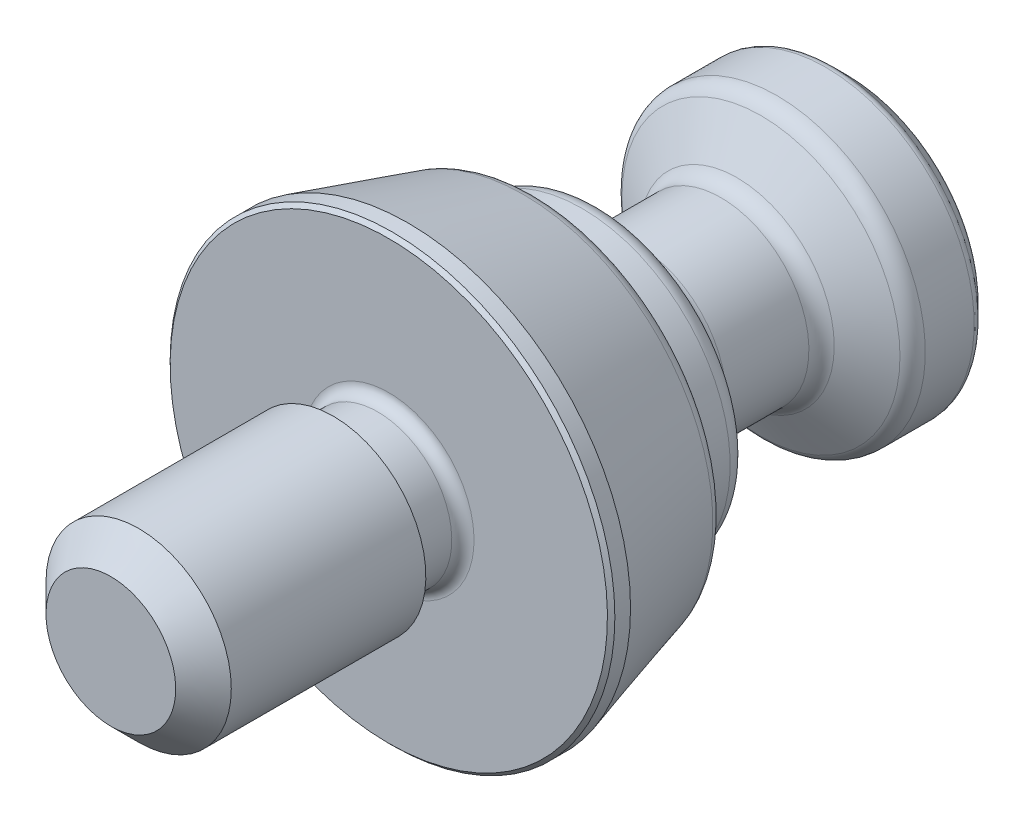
ISO-10303-21;
HEADER;
FILE_DESCRIPTION(('STEP AP214'),'2;1');
FILE_NAME('part.step','',(''),(''),'','','');
FILE_SCHEMA(('AUTOMOTIVE_DESIGN { 1 0 10303 214 1 1 1 1 }'));
ENDSEC;
DATA;
#1=APPLICATION_CONTEXT('core data for automotive mechanical design processes');
#2=APPLICATION_PROTOCOL_DEFINITION('international standard','automotive_design',2000,#1);
#3=PRODUCT_CONTEXT('',#1,'mechanical');
#4=PRODUCT('Part','Part','',(#3));
#5=PRODUCT_RELATED_PRODUCT_CATEGORY('part','',(#4));
#6=PRODUCT_DEFINITION_FORMATION('','',#4);
#7=PRODUCT_DEFINITION_CONTEXT('part definition',#1,'design');
#8=PRODUCT_DEFINITION('design','',#6,#7);
#9=PRODUCT_DEFINITION_SHAPE('','',#8);
#10=(LENGTH_UNIT() NAMED_UNIT(*) SI_UNIT(.MILLI.,.METRE.));
#11=(NAMED_UNIT(*) PLANE_ANGLE_UNIT() SI_UNIT($,.RADIAN.));
#12=(NAMED_UNIT(*) SI_UNIT($,.STERADIAN.) SOLID_ANGLE_UNIT());
#13=UNCERTAINTY_MEASURE_WITH_UNIT(LENGTH_MEASURE(1.E-05),#10,'distance_accuracy_value','');
#14=(GEOMETRIC_REPRESENTATION_CONTEXT(3) GLOBAL_UNCERTAINTY_ASSIGNED_CONTEXT((#13)) GLOBAL_UNIT_ASSIGNED_CONTEXT((#10,
#11,#12)) REPRESENTATION_CONTEXT('',''));
#15=CARTESIAN_POINT('',(0.,0.,0.));
#16=DIRECTION('',(0.,0.,1.));
#17=DIRECTION('',(1.,0.,0.));
#18=AXIS2_PLACEMENT_3D('',#15,#16,#17);
#19=CARTESIAN_POINT('',(2.88675134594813,0.,-21.5));
#20=DIRECTION('',(0.,0.,-1.));
#21=DIRECTION('',(0.,1.,0.));
#22=AXIS2_PLACEMENT_3D('',#19,#20,#21);
#23=PLANE('',#22);
#24=DIRECTION('',(-0.5,0.866025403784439,0.));
#25=VECTOR('',#24,1.);
#26=CARTESIAN_POINT('',(-1.44337567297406,-2.49999999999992,-21.5));
#27=LINE('',#26,#25);
#28=CARTESIAN_POINT('',(-1.44337567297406,-2.49999999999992,-21.5));
#29=VERTEX_POINT('',#28);
#30=CARTESIAN_POINT('',(-2.88675134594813,0.,-21.5));
#31=VERTEX_POINT('',#30);
#32=EDGE_CURVE('E594',#29,#31,#27,.T.);
#33=ORIENTED_EDGE('',*,*,#32,.T.);
#34=DIRECTION('',(0.5,0.866025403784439,0.));
#35=VECTOR('',#34,1.);
#36=CARTESIAN_POINT('',(-2.88675134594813,0.,-21.5));
#37=LINE('',#36,#35);
#38=CARTESIAN_POINT('',(-1.44337567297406,2.50000000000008,-21.5));
#39=VERTEX_POINT('',#38);
#40=EDGE_CURVE('E595',#31,#39,#37,.T.);
#41=ORIENTED_EDGE('',*,*,#40,.T.);
#42=DIRECTION('',(1.,0.,0.));
#43=VECTOR('',#42,1.);
#44=CARTESIAN_POINT('',(-1.44337567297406,2.50000000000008,-21.5));
#45=LINE('',#44,#43);
#46=CARTESIAN_POINT('',(1.44337567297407,2.50000000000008,-21.5));
#47=VERTEX_POINT('',#46);
#48=EDGE_CURVE('E37',#39,#47,#45,.T.);
#49=ORIENTED_EDGE('',*,*,#48,.T.);
#50=DIRECTION('',(0.5,-0.866025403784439,0.));
#51=VECTOR('',#50,1.);
#52=CARTESIAN_POINT('',(1.44337567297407,2.50000000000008,-21.5));
#53=LINE('',#52,#51);
#54=CARTESIAN_POINT('',(2.88675134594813,0.,-21.5));
#55=VERTEX_POINT('',#54);
#56=EDGE_CURVE('E85',#47,#55,#53,.T.);
#57=ORIENTED_EDGE('',*,*,#56,.T.);
#58=DIRECTION('',(-0.5,-0.866025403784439,0.));
#59=VECTOR('',#58,1.);
#60=CARTESIAN_POINT('',(2.88675134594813,0.,-21.5));
#61=LINE('',#60,#59);
#62=CARTESIAN_POINT('',(1.44337567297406,-2.49999999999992,-21.5));
#63=VERTEX_POINT('',#62);
#64=EDGE_CURVE('E598',#55,#63,#61,.T.);
#65=ORIENTED_EDGE('',*,*,#64,.T.);
#66=DIRECTION('',(-1.,0.,0.));
#67=VECTOR('',#66,1.);
#68=CARTESIAN_POINT('',(1.44337567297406,-2.49999999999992,-21.5));
#69=LINE('',#68,#67);
#70=EDGE_CURVE('E596',#63,#29,#69,.T.);
#71=ORIENTED_EDGE('',*,*,#70,.T.);
#72=EDGE_LOOP('',(#33,#41,#49,#57,#65,#71));
#73=FACE_BOUND('',#72,.T.);
#74=ADVANCED_FACE('F14',(#73),#23,.T.);
#75=CARTESIAN_POINT('',(8.0005,0.,-25.));
#76=DIRECTION('',(0.,0.,-1.));
#77=DIRECTION('',(0.,1.,0.));
#78=AXIS2_PLACEMENT_3D('',#75,#76,#77);
#79=PLANE('',#78);
#80=CARTESIAN_POINT('',(0.,0.,-25.));
#81=DIRECTION('',(0.,0.,-1.));
#82=DIRECTION('',(0.,1.,0.));
#83=AXIS2_PLACEMENT_3D('',#80,#81,#82);
#84=CIRCLE('',#83,6.38578643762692);
#85=CARTESIAN_POINT('',(0.,6.38578643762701,-25.));
#86=VERTEX_POINT('',#85);
#87=EDGE_CURVE('E129',#86,#86,#84,.T.);
#88=ORIENTED_EDGE('',*,*,#87,.T.);
#89=EDGE_LOOP('',(#88));
#90=FACE_BOUND('',#89,.T.);
#91=CARTESIAN_POINT('',(0.,0.,-25.));
#92=DIRECTION('',(0.,0.,1.));
#93=DIRECTION('',(0.,-1.,0.));
#94=AXIS2_PLACEMENT_3D('',#91,#92,#93);
#95=CIRCLE('',#94,3.2);
#96=CARTESIAN_POINT('',(0.,-3.19999999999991,-25.));
#97=VERTEX_POINT('',#96);
#98=EDGE_CURVE('E73',#97,#97,#95,.T.);
#99=ORIENTED_EDGE('',*,*,#98,.T.);
#100=EDGE_LOOP('',(#99));
#101=FACE_BOUND('',#100,.T.);
#102=ADVANCED_FACE('F184',(#90,#101),#79,.T.);
#103=CARTESIAN_POINT('',(0.,0.,0.));
#104=DIRECTION('',(0.,0.,1.));
#105=DIRECTION('',(0.,-1.,0.));
#106=AXIS2_PLACEMENT_3D('',#103,#104,#105);
#107=CYLINDRICAL_SURFACE('',#106,8.);
#108=CARTESIAN_POINT('',(0.,0.,-20.9537386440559));
#109=DIRECTION('',(0.,0.,-1.));
#110=DIRECTION('',(0.,1.,0.));
#111=AXIS2_PLACEMENT_3D('',#108,#109,#110);
#112=CIRCLE('',#111,8.);
#113=CARTESIAN_POINT('',(0.,8.00000000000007,-20.9537386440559));
#114=VERTEX_POINT('',#113);
#115=EDGE_CURVE('E153',#114,#114,#112,.T.);
#116=ORIENTED_EDGE('',*,*,#115,.T.);
#117=EDGE_LOOP('',(#116));
#118=FACE_BOUND('',#117,.T.);
#119=CARTESIAN_POINT('',(0.,0.,-23.5928932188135));
#120=DIRECTION('',(0.,0.,-1.));
#121=DIRECTION('',(0.,1.,0.));
#122=AXIS2_PLACEMENT_3D('',#119,#120,#121);
#123=CIRCLE('',#122,8.);
#124=CARTESIAN_POINT('',(0.,8.00000000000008,-23.5928932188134));
#125=VERTEX_POINT('',#124);
#126=EDGE_CURVE('E114',#125,#125,#123,.F.);
#127=ORIENTED_EDGE('',*,*,#126,.T.);
#128=EDGE_LOOP('',(#127));
#129=FACE_BOUND('',#128,.T.);
#130=ADVANCED_FACE('F189',(#118,#129),#107,.T.);
#131=CARTESIAN_POINT('',(0.,0.,0.));
#132=DIRECTION('',(0.,0.,-1.));
#133=DIRECTION('',(0.,1.,0.));
#134=AXIS2_PLACEMENT_3D('',#131,#132,#133);
#135=CYLINDRICAL_SURFACE('',#134,8.0005);
#136=CARTESIAN_POINT('',(0.,0.,-8.4));
#137=DIRECTION('',(0.,0.,-1.));
#138=DIRECTION('',(0.,1.,0.));
#139=AXIS2_PLACEMENT_3D('',#136,#137,#138);
#140=CIRCLE('',#139,8.0005);
#141=CARTESIAN_POINT('',(0.,8.00050000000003,-8.39999999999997));
#142=VERTEX_POINT('',#141);
#143=EDGE_CURVE('E9',#142,#142,#140,.T.);
#144=ORIENTED_EDGE('',*,*,#143,.T.);
#145=EDGE_LOOP('',(#144));
#146=FACE_BOUND('',#145,.T.);
#147=CARTESIAN_POINT('',(0.,0.,-10.4226497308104));
#148=DIRECTION('',(0.,0.,-1.));
#149=DIRECTION('',(0.,1.,0.));
#150=AXIS2_PLACEMENT_3D('',#147,#148,#149);
#151=CIRCLE('',#150,8.0005);
#152=CARTESIAN_POINT('',(0.,8.00050000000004,-10.4226497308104));
#153=VERTEX_POINT('',#152);
#154=EDGE_CURVE('E144',#153,#153,#151,.F.);
#155=ORIENTED_EDGE('',*,*,#154,.T.);
#156=EDGE_LOOP('',(#155));
#157=FACE_BOUND('',#156,.T.);
#158=ADVANCED_FACE('F273',(#146,#157),#135,.T.);
#159=CARTESIAN_POINT('',(0.,0.,0.));
#160=DIRECTION('',(0.,0.,1.));
#161=DIRECTION('',(0.,-1.,0.));
#162=AXIS2_PLACEMENT_3D('',#159,#160,#161);
#163=CYLINDRICAL_SURFACE('',#162,4.75);
#164=CARTESIAN_POINT('',(0.,0.,-17.9226497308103));
#165=DIRECTION('',(0.,0.,1.));
#166=DIRECTION('',(0.,-1.,0.));
#167=AXIS2_PLACEMENT_3D('',#164,#165,#166);
#168=CIRCLE('',#167,4.75);
#169=CARTESIAN_POINT('',(0.,-4.74999999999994,-17.9226497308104));
#170=VERTEX_POINT('',#169);
#171=EDGE_CURVE('E89',#170,#170,#168,.T.);
#172=ORIENTED_EDGE('',*,*,#171,.T.);
#173=EDGE_LOOP('',(#172));
#174=FACE_BOUND('',#173,.T.);
#175=CARTESIAN_POINT('',(0.,0.,-13.4540273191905));
#176=DIRECTION('',(0.,0.,1.));
#177=DIRECTION('',(0.,-1.,0.));
#178=AXIS2_PLACEMENT_3D('',#175,#176,#177);
#179=CIRCLE('',#178,4.75);
#180=CARTESIAN_POINT('',(0.,-4.74999999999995,-13.4540273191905));
#181=VERTEX_POINT('',#180);
#182=EDGE_CURVE('E86',#181,#181,#179,.F.);
#183=ORIENTED_EDGE('',*,*,#182,.T.);
#184=EDGE_LOOP('',(#183));
#185=FACE_BOUND('',#184,.T.);
#186=ADVANCED_FACE('F277',(#174,#185),#163,.T.);
#187=CARTESIAN_POINT('',(0.,0.,-18.5));
#188=DIRECTION('',(0.,0.,-1.));
#189=DIRECTION('',(0.,1.,0.));
#190=AXIS2_PLACEMENT_3D('',#187,#188,#189);
#191=CONICAL_SURFACE('',#190,4.75,1.0471975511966);
#192=CARTESIAN_POINT('',(0.,0.,-20.0877132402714));
#193=DIRECTION('',(0.,0.,1.));
#194=DIRECTION('',(0.,-1.,0.));
#195=AXIS2_PLACEMENT_3D('',#192,#193,#194);
#196=CIRCLE('',#195,7.5);
#197=CARTESIAN_POINT('',(0.,-7.49999999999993,-20.0877132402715));
#198=VERTEX_POINT('',#197);
#199=EDGE_CURVE('E150',#198,#198,#196,.T.);
#200=ORIENTED_EDGE('',*,*,#199,.T.);
#201=EDGE_LOOP('',(#200));
#202=FACE_BOUND('',#201,.T.);
#203=CARTESIAN_POINT('',(0.,0.,-18.7886751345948));
#204=DIRECTION('',(0.,0.,-1.));
#205=DIRECTION('',(0.,1.,0.));
#206=AXIS2_PLACEMENT_3D('',#203,#204,#205);
#207=CIRCLE('',#206,5.25);
#208=CARTESIAN_POINT('',(0.,5.25000000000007,-18.7886751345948));
#209=VERTEX_POINT('',#208);
#210=EDGE_CURVE('E108',#209,#209,#207,.T.);
#211=ORIENTED_EDGE('',*,*,#210,.T.);
#212=EDGE_LOOP('',(#211));
#213=FACE_BOUND('',#212,.T.);
#214=ADVANCED_FACE('F269',(#202,#213),#191,.T.);
#215=CARTESIAN_POINT('',(0.,0.,-11.));
#216=DIRECTION('',(0.,0.,1.));
#217=DIRECTION('',(0.,-1.,0.));
#218=AXIS2_PLACEMENT_3D('',#215,#216,#217);
#219=CONICAL_SURFACE('',#218,8.0005,1.0471975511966);
#220=CARTESIAN_POINT('',(0.,0.,-11.2886751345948));
#221=DIRECTION('',(0.,0.,-1.));
#222=DIRECTION('',(0.,1.,0.));
#223=AXIS2_PLACEMENT_3D('',#220,#221,#222);
#224=CIRCLE('',#223,7.5005);
#225=CARTESIAN_POINT('',(0.,7.50050000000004,-11.2886751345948));
#226=VERTEX_POINT('',#225);
#227=EDGE_CURVE('E147',#226,#226,#224,.T.);
#228=ORIENTED_EDGE('',*,*,#227,.T.);
#229=EDGE_LOOP('',(#228));
#230=FACE_BOUND('',#229,.T.);
#231=CARTESIAN_POINT('',(0.,0.,-12.5880019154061));
#232=DIRECTION('',(0.,0.,1.));
#233=DIRECTION('',(0.,-1.,0.));
#234=AXIS2_PLACEMENT_3D('',#231,#232,#233);
#235=CIRCLE('',#234,5.25);
#236=CARTESIAN_POINT('',(0.,-5.24999999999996,-12.5880019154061));
#237=VERTEX_POINT('',#236);
#238=EDGE_CURVE('E111',#237,#237,#235,.T.);
#239=ORIENTED_EDGE('',*,*,#238,.T.);
#240=EDGE_LOOP('',(#239));
#241=FACE_BOUND('',#240,.T.);
#242=ADVANCED_FACE('F266',(#230,#241),#219,.T.);
#243=CARTESIAN_POINT('',(0.,0.,-23.8));
#244=DIRECTION('',(0.,0.,1.));
#245=DIRECTION('',(0.,-1.,0.));
#246=AXIS2_PLACEMENT_3D('',#243,#244,#245);
#247=CONICAL_SURFACE('',#246,8.,0.785398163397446);
#248=CARTESIAN_POINT('',(0.,0.,-24.7071067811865));
#249=DIRECTION('',(0.,0.,-1.));
#250=DIRECTION('',(0.,1.,0.));
#251=AXIS2_PLACEMENT_3D('',#248,#249,#250);
#252=CIRCLE('',#251,7.09289321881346);
#253=CARTESIAN_POINT('',(0.,7.09289321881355,-24.7071067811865));
#254=VERTEX_POINT('',#253);
#255=EDGE_CURVE('E126',#254,#254,#252,.F.);
#256=ORIENTED_EDGE('',*,*,#255,.T.);
#257=EDGE_LOOP('',(#256));
#258=FACE_BOUND('',#257,.T.);
#259=CARTESIAN_POINT('',(0.,0.,-23.9464466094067));
#260=DIRECTION('',(0.,0.,-1.));
#261=DIRECTION('',(0.,1.,0.));
#262=AXIS2_PLACEMENT_3D('',#259,#260,#261);
#263=CIRCLE('',#262,7.85355339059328);
#264=CARTESIAN_POINT('',(0.,7.85355339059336,-23.9464466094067));
#265=VERTEX_POINT('',#264);
#266=EDGE_CURVE('E117',#265,#265,#263,.T.);
#267=ORIENTED_EDGE('',*,*,#266,.T.);
#268=EDGE_LOOP('',(#267));
#269=FACE_BOUND('',#268,.T.);
#270=ADVANCED_FACE('F194',(#258,#269),#247,.T.);
#271=CARTESIAN_POINT('',(0.,0.,-17.9226497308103));
#272=DIRECTION('',(0.,0.,1.));
#273=DIRECTION('',(0.,-1.,0.));
#274=AXIS2_PLACEMENT_3D('',#271,#272,#273);
#275=TOROIDAL_SURFACE('',#274,5.75,1.);
#276=ORIENTED_EDGE('',*,*,#210,.F.);
#277=EDGE_LOOP('',(#276));
#278=FACE_BOUND('',#277,.T.);
#279=ORIENTED_EDGE('',*,*,#171,.F.);
#280=EDGE_LOOP('',(#279));
#281=FACE_BOUND('',#280,.T.);
#282=ADVANCED_FACE('F300',(#278,#281),#275,.F.);
#283=CARTESIAN_POINT('',(0.,0.,-13.4540273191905));
#284=DIRECTION('',(0.,0.,1.));
#285=DIRECTION('',(0.,-1.,0.));
#286=AXIS2_PLACEMENT_3D('',#283,#284,#285);
#287=TOROIDAL_SURFACE('',#286,5.75,1.);
#288=ORIENTED_EDGE('',*,*,#182,.F.);
#289=EDGE_LOOP('',(#288));
#290=FACE_BOUND('',#289,.T.);
#291=ORIENTED_EDGE('',*,*,#238,.F.);
#292=EDGE_LOOP('',(#291));
#293=FACE_BOUND('',#292,.T.);
#294=ADVANCED_FACE('F303',(#290,#293),#287,.F.);
#295=CARTESIAN_POINT('',(0.,0.,-23.5928932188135));
#296=DIRECTION('',(0.,0.,-1.));
#297=DIRECTION('',(0.,1.,0.));
#298=AXIS2_PLACEMENT_3D('',#295,#296,#297);
#299=TOROIDAL_SURFACE('',#298,7.5,0.5);
#300=ORIENTED_EDGE('',*,*,#266,.F.);
#301=EDGE_LOOP('',(#300));
#302=FACE_BOUND('',#301,.T.);
#303=ORIENTED_EDGE('',*,*,#126,.F.);
#304=EDGE_LOOP('',(#303));
#305=FACE_BOUND('',#304,.T.);
#306=ADVANCED_FACE('F307',(#302,#305),#299,.T.);
#307=CARTESIAN_POINT('',(0.,0.,-24.));
#308=DIRECTION('',(0.,0.,-1.));
#309=DIRECTION('',(0.,1.,0.));
#310=AXIS2_PLACEMENT_3D('',#307,#308,#309);
#311=TOROIDAL_SURFACE('',#310,6.38578643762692,1.);
#312=ORIENTED_EDGE('',*,*,#87,.F.);
#313=EDGE_LOOP('',(#312));
#314=FACE_BOUND('',#313,.T.);
#315=ORIENTED_EDGE('',*,*,#255,.F.);
#316=EDGE_LOOP('',(#315));
#317=FACE_BOUND('',#316,.T.);
#318=ADVANCED_FACE('F223',(#314,#317),#311,.T.);
#319=CARTESIAN_POINT('',(0.,0.,-25.));
#320=DIRECTION('',(0.,0.,-1.));
#321=DIRECTION('',(0.,1.,0.));
#322=AXIS2_PLACEMENT_3D('',#319,#320,#321);
#323=CONICAL_SURFACE('',#322,3.2,1.0471975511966);
#324=ORIENTED_EDGE('',*,*,#98,.F.);
#325=EDGE_LOOP('',(#324));
#326=FACE_BOUND('',#325,.T.);
#327=CARTESIAN_POINT('',(1.44326020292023,-2.50019999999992,-24.8192124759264));
#328=CARTESIAN_POINT('',(1.50668977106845,-2.39033676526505,-24.7825764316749));
#329=CARTESIAN_POINT('',(1.57066685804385,-2.27952520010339,-24.7492570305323));
#330=CARTESIAN_POINT('',(1.69972891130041,-2.05598316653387,-24.6910970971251));
#331=CARTESIAN_POINT('',(1.7648161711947,-1.94324872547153,-24.666277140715));
#332=CARTESIAN_POINT('',(1.8941840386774,-1.71917700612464,-24.6276404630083));
#333=CARTESIAN_POINT('',(1.95844473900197,-1.60787420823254,-24.6135666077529));
#334=CARTESIAN_POINT('',(2.08726857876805,-1.38474477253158,-24.59676396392));
#335=CARTESIAN_POINT('',(2.15183124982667,-1.27291894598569,-24.5940212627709));
#336=CARTESIAN_POINT('',(2.27247489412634,-1.06395802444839,-24.5997205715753));
#337=CARTESIAN_POINT('',(2.32857390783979,-0.966791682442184,-24.6067632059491));
#338=CARTESIAN_POINT('',(2.44040644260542,-0.773092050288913,-24.6290862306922));
#339=CARTESIAN_POINT('',(2.49613957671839,-0.676559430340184,-24.6443742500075));
#340=CARTESIAN_POINT('',(2.60820277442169,-0.48246027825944,-24.6825939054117));
#341=CARTESIAN_POINT('',(2.66451865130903,-0.384918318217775,-24.7056875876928));
#342=CARTESIAN_POINT('',(2.77631036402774,-0.19128939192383,-24.7581014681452));
#343=CARTESIAN_POINT('',(2.83178763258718,-0.0951999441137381,-24.7874093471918));
#344=CARTESIAN_POINT('',(2.88686681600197,0.00020000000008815,-24.8192124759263));
#345=B_SPLINE_CURVE_WITH_KNOTS('',3,(#327,#328,#329,#330,#331,#332,#333,#334,#335,#336,#337,
#338,#339,#340,#341,#342,#343,#344),.UNSPECIFIED.,.F.,.F.,(4,2,2,2,2,2,2,2,4),(0.,
0.396285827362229,0.793524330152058,1.18093086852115,1.56786160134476,1.90479741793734,
2.24204551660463,2.58677531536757,2.93082800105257),.UNSPECIFIED.);
#346=CARTESIAN_POINT('',(1.44337567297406,-2.49999999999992,-24.8191458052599));
#347=VERTEX_POINT('',#346);
#348=CARTESIAN_POINT('',(2.88675134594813,0.,-24.8191458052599));
#349=VERTEX_POINT('',#348);
#350=EDGE_CURVE('E29',#347,#349,#345,.T.);
#351=ORIENTED_EDGE('',*,*,#350,.T.);
#352=CARTESIAN_POINT('',(2.88686681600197,-0.000199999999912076,-24.8192124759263));
#353=CARTESIAN_POINT('',(2.82343724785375,0.109663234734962,-24.7825764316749));
#354=CARTESIAN_POINT('',(2.75946016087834,0.220474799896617,-24.7492570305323));
#355=CARTESIAN_POINT('',(2.63039810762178,0.44401683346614,-24.6910970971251));
#356=CARTESIAN_POINT('',(2.5653108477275,0.556751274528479,-24.666277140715));
#357=CARTESIAN_POINT('',(2.43594298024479,0.780822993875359,-24.6276404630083));
#358=CARTESIAN_POINT('',(2.37168227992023,0.892125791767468,-24.6135666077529));
#359=CARTESIAN_POINT('',(2.24285844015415,1.11525522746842,-24.59676396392));
#360=CARTESIAN_POINT('',(2.17829576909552,1.22708105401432,-24.5940212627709));
#361=CARTESIAN_POINT('',(2.05765212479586,1.43604197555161,-24.5997205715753));
#362=CARTESIAN_POINT('',(2.0015531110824,1.53320831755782,-24.6067632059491));
#363=CARTESIAN_POINT('',(1.88972057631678,1.72690794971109,-24.6290862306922));
#364=CARTESIAN_POINT('',(1.8339874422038,1.82344056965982,-24.6443742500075));
#365=CARTESIAN_POINT('',(1.72192424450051,2.01753972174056,-24.6825939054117));
#366=CARTESIAN_POINT('',(1.66560836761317,2.11508168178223,-24.7056875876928));
#367=CARTESIAN_POINT('',(1.55381665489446,2.30871060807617,-24.7581014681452));
#368=CARTESIAN_POINT('',(1.49833938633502,2.40480005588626,-24.7874093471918));
#369=CARTESIAN_POINT('',(1.44326020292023,2.50020000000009,-24.8192124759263));
#370=B_SPLINE_CURVE_WITH_KNOTS('',3,(#352,#353,#354,#355,#356,#357,#358,#359,#360,#361,#362,
#363,#364,#365,#366,#367,#368,#369),.UNSPECIFIED.,.F.,.F.,(4,2,2,2,2,2,2,2,4),(0.,
0.396285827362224,0.793524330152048,1.18093086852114,1.56786160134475,1.90479741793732,
2.24204551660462,2.58677531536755,2.93082800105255),.UNSPECIFIED.);
#371=CARTESIAN_POINT('',(1.44337567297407,2.50000000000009,-24.8191458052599));
#372=VERTEX_POINT('',#371);
#373=EDGE_CURVE('E64',#349,#372,#370,.T.);
#374=ORIENTED_EDGE('',*,*,#373,.T.);
#375=CARTESIAN_POINT('',(-3.77372348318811,2.50000000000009,-25.7659690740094));
#376=CARTESIAN_POINT('',(-3.66532713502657,2.50000000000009,-25.7138116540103));
#377=CARTESIAN_POINT('',(-3.5566704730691,2.50000000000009,-25.6621853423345));
#378=CARTESIAN_POINT('',(-3.3386975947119,2.50000000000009,-25.5602960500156));
#379=CARTESIAN_POINT('',(-3.22938126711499,2.50000000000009,-25.5100333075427));
#380=CARTESIAN_POINT('',(-3.00933576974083,2.50000000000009,-25.4108968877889));
#381=CARTESIAN_POINT('',(-2.89860206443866,2.50000000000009,-25.3620332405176));
#382=CARTESIAN_POINT('',(-2.67621651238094,2.50000000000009,-25.2664499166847));
#383=CARTESIAN_POINT('',(-2.56456471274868,2.50000000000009,-25.2197301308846));
#384=CARTESIAN_POINT('',(-2.33704252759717,2.50000000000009,-25.1277417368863));
#385=CARTESIAN_POINT('',(-2.22114109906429,2.50000000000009,-25.082549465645));
#386=CARTESIAN_POINT('',(-1.98794483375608,2.50000000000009,-24.9958424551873));
#387=CARTESIAN_POINT('',(-1.87064983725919,2.50000000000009,-24.9543281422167));
#388=CARTESIAN_POINT('',(-1.63473483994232,2.50000000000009,-24.8761429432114));
#389=CARTESIAN_POINT('',(-1.51611844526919,2.50000000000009,-24.8394612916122));
#390=CARTESIAN_POINT('',(-1.27718906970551,2.50000000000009,-24.7721855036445));
#391=CARTESIAN_POINT('',(-1.15687666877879,2.50000000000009,-24.7415893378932));
#392=CARTESIAN_POINT('',(-0.915104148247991,2.50000000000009,-24.6881678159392));
#393=CARTESIAN_POINT('',(-0.793652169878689,2.50000000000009,-24.6653063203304));
#394=CARTESIAN_POINT('',(-0.549353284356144,2.50000000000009,-24.628724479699));
#395=CARTESIAN_POINT('',(-0.426506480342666,2.50000000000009,-24.6150034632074));
#396=CARTESIAN_POINT('',(-0.181589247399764,2.50000000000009,-24.5979769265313));
#397=CARTESIAN_POINT('',(-0.0595277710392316,2.50000000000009,-24.5945457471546));
#398=CARTESIAN_POINT('',(0.18445324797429,2.50000000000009,-24.5980647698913));
#399=CARTESIAN_POINT('',(0.306372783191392,2.50000000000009,-24.6050154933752));
#400=CARTESIAN_POINT('',(0.516525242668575,2.50000000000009,-24.6254710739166));
#401=CARTESIAN_POINT('',(0.604990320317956,2.50000000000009,-24.636707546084));
#402=CARTESIAN_POINT('',(0.781201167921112,2.50000000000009,-24.6638879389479));
#403=CARTESIAN_POINT('',(0.868946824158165,2.50000000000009,-24.6798325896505));
#404=CARTESIAN_POINT('',(1.13101461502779,2.50000000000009,-24.73388535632));
#405=CARTESIAN_POINT('',(1.30405772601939,2.50000000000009,-24.7782002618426));
#406=CARTESIAN_POINT('',(1.65032858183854,2.50000000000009,-24.879785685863));
#407=CARTESIAN_POINT('',(1.82347546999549,2.50000000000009,-24.937321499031));
#408=CARTESIAN_POINT('',(2.08081862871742,2.50000000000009,-25.0300094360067));
#409=CARTESIAN_POINT('',(2.16619199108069,2.50000000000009,-25.0619646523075));
#410=CARTESIAN_POINT('',(2.33624768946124,2.50000000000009,-25.1276627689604));
#411=CARTESIAN_POINT('',(2.42093003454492,2.50000000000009,-25.1614056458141));
#412=CARTESIAN_POINT('',(2.62603474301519,2.50000000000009,-25.2452265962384));
#413=CARTESIAN_POINT('',(2.7461393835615,2.50000000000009,-25.2960801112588));
#414=CARTESIAN_POINT('',(2.9853252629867,2.50000000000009,-25.4001455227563));
#415=CARTESIAN_POINT('',(3.10440644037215,2.50000000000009,-25.4533575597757));
#416=CARTESIAN_POINT('',(3.46043992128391,2.50000000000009,-25.6157641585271));
#417=CARTESIAN_POINT('',(3.69613537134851,2.50000000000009,-25.7277095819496));
#418=CARTESIAN_POINT('',(4.16548797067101,2.50000000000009,-25.9563787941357));
#419=CARTESIAN_POINT('',(4.39914263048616,2.50000000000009,-26.0731076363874));
#420=CARTESIAN_POINT('',(4.86481739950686,2.50000000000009,-26.3097054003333));
#421=CARTESIAN_POINT('',(5.09683770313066,2.50000000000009,-26.4295739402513));
#422=CARTESIAN_POINT('',(5.5396497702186,2.50000000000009,-26.6610256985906));
#423=CARTESIAN_POINT('',(5.75053751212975,2.50000000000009,-26.7724259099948));
#424=CARTESIAN_POINT('',(6.17158854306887,2.50000000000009,-26.9966038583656));
#425=CARTESIAN_POINT('',(6.38175180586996,2.50000000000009,-27.1093816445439));
#426=CARTESIAN_POINT('',(6.80101584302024,2.5000000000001,-27.3357110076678));
#427=CARTESIAN_POINT('',(7.01011795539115,2.5000000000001,-27.4492601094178));
#428=CARTESIAN_POINT('',(7.42786313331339,2.5000000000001,-27.6771738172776));
#429=CARTESIAN_POINT('',(7.63650622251,2.5000000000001,-27.7915383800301));
#430=CARTESIAN_POINT('',(7.84498187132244,2.5000000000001,-27.9062054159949));
#431=B_SPLINE_CURVE_WITH_KNOTS('',3,(#375,#376,#377,#378,#379,#380,#381,#382,#383,#384,#385,
#386,#387,#388,#389,#390,#391,#392,#393,#394,#395,#396,#397,#398,#399,#400,#401,#402,#403,#404,
#405,#406,#407,#408,#409,#410,#411,#412,#413,#414,#415,#416,#417,#418,#419,#420,#421,#422,#423,
#424,#425,#426,#427,#428,#429,#430),.UNSPECIFIED.,.F.,.F.,(4,2,2,2,2,2,2,2,2,2,2,2,2,2,2,2,2,2,
2,2,2,2,2,2,2,2,2,4),(0.,0.360880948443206,0.721824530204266,1.08491311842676,1.44798318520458,
1.8211364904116,2.19433298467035,2.56668353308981,2.93890970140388,3.30937185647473,
3.6798067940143,4.04569918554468,4.41160995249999,4.67900678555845,4.94644510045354,
5.48165172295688,6.02871656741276,6.30217432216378,6.57562848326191,6.96687524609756,
7.35814535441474,8.14083774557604,8.92437948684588,9.70782639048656,10.4233292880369,
11.1388578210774,11.8526862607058,12.5664770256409),.UNSPECIFIED.);
#432=CARTESIAN_POINT('',(-1.44337567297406,2.50000000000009,-24.8191458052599));
#433=VERTEX_POINT('',#432);
#434=EDGE_CURVE('E67',#372,#433,#431,.F.);
#435=ORIENTED_EDGE('',*,*,#434,.T.);
#436=CARTESIAN_POINT('',(-1.44326020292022,2.50020000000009,-24.8192124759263));
#437=CARTESIAN_POINT('',(-1.50668977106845,2.39033676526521,-24.7825764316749));
#438=CARTESIAN_POINT('',(-1.57066685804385,2.27952520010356,-24.7492570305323));
#439=CARTESIAN_POINT('',(-1.69972891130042,2.05598316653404,-24.6910970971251));
#440=CARTESIAN_POINT('',(-1.7648161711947,1.9432487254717,-24.666277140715));
#441=CARTESIAN_POINT('',(-1.8941840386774,1.71917700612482,-24.6276404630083));
#442=CARTESIAN_POINT('',(-1.95844473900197,1.60787420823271,-24.6135666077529));
#443=CARTESIAN_POINT('',(-2.08726857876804,1.38474477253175,-24.59676396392));
#444=CARTESIAN_POINT('',(-2.15183124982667,1.27291894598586,-24.5940212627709));
#445=CARTESIAN_POINT('',(-2.27247489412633,1.06395802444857,-24.5997205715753));
#446=CARTESIAN_POINT('',(-2.32857390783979,0.966791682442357,-24.6067632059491));
#447=CARTESIAN_POINT('',(-2.44040644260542,0.773092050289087,-24.6290862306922));
#448=CARTESIAN_POINT('',(-2.49613957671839,0.676559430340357,-24.6443742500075));
#449=CARTESIAN_POINT('',(-2.60820277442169,0.482460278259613,-24.6825939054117));
#450=CARTESIAN_POINT('',(-2.66451865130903,0.38491831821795,-24.7056875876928));
#451=CARTESIAN_POINT('',(-2.77631036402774,0.191289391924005,-24.7581014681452));
#452=CARTESIAN_POINT('',(-2.83178763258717,0.0951999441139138,-24.7874093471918));
#453=CARTESIAN_POINT('',(-2.88686681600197,-0.000199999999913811,-24.8192124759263));
#454=B_SPLINE_CURVE_WITH_KNOTS('',3,(#436,#437,#438,#439,#440,#441,#442,#443,#444,#445,#446,
#447,#448,#449,#450,#451,#452,#453),.UNSPECIFIED.,.F.,.F.,(4,2,2,2,2,2,2,2,4),(0.,
0.396285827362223,0.793524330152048,1.18093086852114,1.56786160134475,1.90479741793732,
2.24204551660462,2.58677531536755,2.93082800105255),.UNSPECIFIED.);
#455=CARTESIAN_POINT('',(-2.88675134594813,0.,-24.8191458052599));
#456=VERTEX_POINT('',#455);
#457=EDGE_CURVE('E82',#433,#456,#454,.T.);
#458=ORIENTED_EDGE('',*,*,#457,.T.);
#459=CARTESIAN_POINT('',(-2.88686681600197,0.000200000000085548,-24.8192124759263));
#460=CARTESIAN_POINT('',(-2.82343724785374,-0.109663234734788,-24.7825764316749));
#461=CARTESIAN_POINT('',(-2.75946016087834,-0.220474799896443,-24.7492570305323));
#462=CARTESIAN_POINT('',(-2.63039810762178,-0.444016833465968,-24.6910970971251));
#463=CARTESIAN_POINT('',(-2.56531084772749,-0.556751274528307,-24.666277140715));
#464=CARTESIAN_POINT('',(-2.43594298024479,-0.780822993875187,-24.6276404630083));
#465=CARTESIAN_POINT('',(-2.37168227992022,-0.892125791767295,-24.6135666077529));
#466=CARTESIAN_POINT('',(-2.24285844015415,-1.11525522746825,-24.59676396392));
#467=CARTESIAN_POINT('',(-2.17829576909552,-1.22708105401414,-24.5940212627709));
#468=CARTESIAN_POINT('',(-2.05765212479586,-1.43604197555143,-24.5997205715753));
#469=CARTESIAN_POINT('',(-2.0015531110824,-1.53320831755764,-24.6067632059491));
#470=CARTESIAN_POINT('',(-1.88972057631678,-1.72690794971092,-24.6290862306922));
#471=CARTESIAN_POINT('',(-1.8339874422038,-1.82344056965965,-24.6443742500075));
#472=CARTESIAN_POINT('',(-1.7219242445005,-2.01753972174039,-24.6825939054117));
#473=CARTESIAN_POINT('',(-1.66560836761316,-2.11508168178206,-24.7056875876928));
#474=CARTESIAN_POINT('',(-1.55381665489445,-2.308710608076,-24.7581014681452));
#475=CARTESIAN_POINT('',(-1.49833938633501,-2.40480005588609,-24.7874093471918));
#476=CARTESIAN_POINT('',(-1.44326020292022,-2.50019999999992,-24.8192124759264));
#477=B_SPLINE_CURVE_WITH_KNOTS('',3,(#459,#460,#461,#462,#463,#464,#465,#466,#467,#468,#469,
#470,#471,#472,#473,#474,#475,#476),.UNSPECIFIED.,.F.,.F.,(4,2,2,2,2,2,2,2,4),(0.,
0.396285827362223,0.793524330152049,1.18093086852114,1.56786160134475,1.90479741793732,
2.24204551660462,2.58677531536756,2.93082800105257),.UNSPECIFIED.);
#478=CARTESIAN_POINT('',(-1.44337567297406,-2.49999999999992,-24.8191458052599));
#479=VERTEX_POINT('',#478);
#480=EDGE_CURVE('E234',#456,#479,#477,.T.);
#481=ORIENTED_EDGE('',*,*,#480,.T.);
#482=CARTESIAN_POINT('',(-3.77372348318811,-2.49999999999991,-25.7659690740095));
#483=CARTESIAN_POINT('',(-3.66532713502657,-2.49999999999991,-25.7138116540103));
#484=CARTESIAN_POINT('',(-3.55667047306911,-2.49999999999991,-25.6621853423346));
#485=CARTESIAN_POINT('',(-3.33869759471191,-2.49999999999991,-25.5602960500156));
#486=CARTESIAN_POINT('',(-3.22938126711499,-2.49999999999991,-25.5100333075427));
#487=CARTESIAN_POINT('',(-3.00933576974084,-2.49999999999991,-25.4108968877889));
#488=CARTESIAN_POINT('',(-2.89860206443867,-2.49999999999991,-25.3620332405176));
#489=CARTESIAN_POINT('',(-2.67621651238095,-2.49999999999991,-25.2664499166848));
#490=CARTESIAN_POINT('',(-2.56456471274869,-2.49999999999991,-25.2197301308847));
#491=CARTESIAN_POINT('',(-2.33704252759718,-2.49999999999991,-25.1277417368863));
#492=CARTESIAN_POINT('',(-2.2211410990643,-2.49999999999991,-25.082549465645));
#493=CARTESIAN_POINT('',(-1.98794483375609,-2.49999999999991,-24.9958424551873));
#494=CARTESIAN_POINT('',(-1.8706498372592,-2.49999999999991,-24.9543281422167));
#495=CARTESIAN_POINT('',(-1.63473483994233,-2.49999999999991,-24.8761429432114));
#496=CARTESIAN_POINT('',(-1.5161184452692,-2.49999999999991,-24.8394612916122));
#497=CARTESIAN_POINT('',(-1.27718906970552,-2.49999999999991,-24.7721855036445));
#498=CARTESIAN_POINT('',(-1.15687666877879,-2.49999999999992,-24.7415893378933));
#499=CARTESIAN_POINT('',(-0.915104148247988,-2.49999999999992,-24.6881678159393));
#500=CARTESIAN_POINT('',(-0.793652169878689,-2.49999999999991,-24.6653063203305));
#501=CARTESIAN_POINT('',(-0.549353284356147,-2.49999999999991,-24.628724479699));
#502=CARTESIAN_POINT('',(-0.426506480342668,-2.49999999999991,-24.6150034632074));
#503=CARTESIAN_POINT('',(-0.181589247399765,-2.49999999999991,-24.5979769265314));
#504=CARTESIAN_POINT('',(-0.059527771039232,-2.49999999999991,-24.5945457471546));
#505=CARTESIAN_POINT('',(0.184453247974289,-2.49999999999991,-24.5980647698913));
#506=CARTESIAN_POINT('',(0.30637278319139,-2.49999999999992,-24.6050154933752));
#507=CARTESIAN_POINT('',(0.516525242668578,-2.49999999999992,-24.6254710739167));
#508=CARTESIAN_POINT('',(0.604990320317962,-2.49999999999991,-24.636707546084));
#509=CARTESIAN_POINT('',(0.781201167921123,-2.49999999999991,-24.6638879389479));
#510=CARTESIAN_POINT('',(0.868946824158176,-2.49999999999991,-24.6798325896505));
#511=CARTESIAN_POINT('',(1.1310146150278,-2.49999999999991,-24.7338853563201));
#512=CARTESIAN_POINT('',(1.3040577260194,-2.49999999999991,-24.7782002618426));
#513=CARTESIAN_POINT('',(1.65032858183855,-2.49999999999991,-24.879785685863));
#514=CARTESIAN_POINT('',(1.8234754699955,-2.49999999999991,-24.9373214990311));
#515=CARTESIAN_POINT('',(2.08081862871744,-2.49999999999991,-25.0300094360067));
#516=CARTESIAN_POINT('',(2.16619199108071,-2.49999999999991,-25.0619646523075));
#517=CARTESIAN_POINT('',(2.33624768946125,-2.49999999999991,-25.1276627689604));
#518=CARTESIAN_POINT('',(2.42093003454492,-2.49999999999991,-25.1614056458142));
#519=CARTESIAN_POINT('',(2.62603474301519,-2.49999999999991,-25.2452265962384));
#520=CARTESIAN_POINT('',(2.74613938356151,-2.49999999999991,-25.2960801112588));
#521=CARTESIAN_POINT('',(2.98532526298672,-2.49999999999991,-25.4001455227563));
#522=CARTESIAN_POINT('',(3.10440644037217,-2.49999999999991,-25.4533575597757));
#523=CARTESIAN_POINT('',(3.46043992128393,-2.49999999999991,-25.6157641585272));
#524=CARTESIAN_POINT('',(3.69613537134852,-2.49999999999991,-25.7277095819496));
#525=CARTESIAN_POINT('',(4.16548797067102,-2.49999999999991,-25.9563787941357));
#526=CARTESIAN_POINT('',(4.39914263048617,-2.49999999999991,-26.0731076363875));
#527=CARTESIAN_POINT('',(4.86481739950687,-2.49999999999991,-26.3097054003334));
#528=CARTESIAN_POINT('',(5.09683770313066,-2.49999999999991,-26.4295739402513));
#529=CARTESIAN_POINT('',(5.5396497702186,-2.49999999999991,-26.6610256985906));
#530=CARTESIAN_POINT('',(5.75053751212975,-2.49999999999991,-26.7724259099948));
#531=CARTESIAN_POINT('',(6.17158854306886,-2.49999999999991,-26.9966038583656));
#532=CARTESIAN_POINT('',(6.38175180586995,-2.49999999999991,-27.109381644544));
#533=CARTESIAN_POINT('',(6.80101584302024,-2.4999999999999,-27.3357110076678));
#534=CARTESIAN_POINT('',(7.01011795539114,-2.4999999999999,-27.4492601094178));
#535=CARTESIAN_POINT('',(7.42786313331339,-2.4999999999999,-27.6771738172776));
#536=CARTESIAN_POINT('',(7.63650622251,-2.4999999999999,-27.7915383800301));
#537=CARTESIAN_POINT('',(7.84498187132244,-2.4999999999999,-27.9062054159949));
#538=B_SPLINE_CURVE_WITH_KNOTS('',3,(#482,#483,#484,#485,#486,#487,#488,#489,#490,#491,#492,
#493,#494,#495,#496,#497,#498,#499,#500,#501,#502,#503,#504,#505,#506,#507,#508,#509,#510,#511,
#512,#513,#514,#515,#516,#517,#518,#519,#520,#521,#522,#523,#524,#525,#526,#527,#528,#529,#530,
#531,#532,#533,#534,#535,#536,#537),.UNSPECIFIED.,.F.,.F.,(4,2,2,2,2,2,2,2,2,2,2,2,2,2,2,2,2,2,
2,2,2,2,2,2,2,2,2,4),(0.,0.360880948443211,0.721824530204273,1.08491311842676,1.44798318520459,
1.8211364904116,2.19433298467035,2.56668353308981,2.93890970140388,3.30937185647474,
3.67980679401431,4.04569918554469,4.41160995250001,4.67900678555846,4.94644510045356,
5.48165172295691,6.02871656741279,6.3021743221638,6.57562848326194,6.96687524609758,
7.35814535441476,8.14083774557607,8.9243794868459,9.70782639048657,10.4233292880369,
11.1388578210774,11.8526862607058,12.5664770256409),.UNSPECIFIED.);
#539=EDGE_CURVE('E240',#479,#347,#538,.T.);
#540=ORIENTED_EDGE('',*,*,#539,.T.);
#541=EDGE_LOOP('',(#351,#374,#435,#458,#481,#540));
#542=FACE_BOUND('',#541,.T.);
#543=ADVANCED_FACE('F66',(#326,#542),#323,.F.);
#544=CARTESIAN_POINT('',(1.44337567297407,2.50000000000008,-21.5));
#545=DIRECTION('',(0.866025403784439,0.5,0.));
#546=DIRECTION('',(-0.5,0.866025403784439,0.));
#547=AXIS2_PLACEMENT_3D('',#544,#545,#546);
#548=PLANE('',#547);
#549=ORIENTED_EDGE('',*,*,#373,.F.);
#550=DIRECTION('',(0.,0.,-1.));
#551=VECTOR('',#550,1.);
#552=CARTESIAN_POINT('',(2.88675134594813,0.,-21.5));
#553=LINE('',#552,#551);
#554=EDGE_CURVE('E104',#55,#349,#553,.T.);
#555=ORIENTED_EDGE('',*,*,#554,.F.);
#556=ORIENTED_EDGE('',*,*,#56,.F.);
#557=DIRECTION('',(0.,0.,-1.));
#558=VECTOR('',#557,1.);
#559=CARTESIAN_POINT('',(1.44337567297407,2.50000000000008,-21.5));
#560=LINE('',#559,#558);
#561=EDGE_CURVE('E78',#47,#372,#560,.T.);
#562=ORIENTED_EDGE('',*,*,#561,.T.);
#563=EDGE_LOOP('',(#549,#555,#556,#562));
#564=FACE_BOUND('',#563,.T.);
#565=ADVANCED_FACE('F84',(#564),#548,.F.);
#566=CARTESIAN_POINT('',(-1.44337567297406,2.50000000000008,-21.5));
#567=DIRECTION('',(0.,1.,0.));
#568=DIRECTION('',(-1.,0.,0.));
#569=AXIS2_PLACEMENT_3D('',#566,#567,#568);
#570=PLANE('',#569);
#571=ORIENTED_EDGE('',*,*,#434,.F.);
#572=ORIENTED_EDGE('',*,*,#561,.F.);
#573=ORIENTED_EDGE('',*,*,#48,.F.);
#574=DIRECTION('',(0.,0.,-1.));
#575=VECTOR('',#574,1.);
#576=CARTESIAN_POINT('',(-1.44337567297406,2.50000000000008,-21.5));
#577=LINE('',#576,#575);
#578=EDGE_CURVE('E81',#39,#433,#577,.T.);
#579=ORIENTED_EDGE('',*,*,#578,.T.);
#580=EDGE_LOOP('',(#571,#572,#573,#579));
#581=FACE_BOUND('',#580,.T.);
#582=ADVANCED_FACE('F77',(#581),#570,.F.);
#583=CARTESIAN_POINT('',(-2.88675134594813,0.,-21.5));
#584=DIRECTION('',(-0.866025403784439,0.5,0.));
#585=DIRECTION('',(-0.5,-0.866025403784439,0.));
#586=AXIS2_PLACEMENT_3D('',#583,#584,#585);
#587=PLANE('',#586);
#588=ORIENTED_EDGE('',*,*,#457,.F.);
#589=ORIENTED_EDGE('',*,*,#578,.F.);
#590=ORIENTED_EDGE('',*,*,#40,.F.);
#591=DIRECTION('',(0.,0.,-1.));
#592=VECTOR('',#591,1.);
#593=CARTESIAN_POINT('',(-2.88675134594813,0.,-21.5));
#594=LINE('',#593,#592);
#595=EDGE_CURVE('E91',#31,#456,#594,.T.);
#596=ORIENTED_EDGE('',*,*,#595,.T.);
#597=EDGE_LOOP('',(#588,#589,#590,#596));
#598=FACE_BOUND('',#597,.T.);
#599=ADVANCED_FACE('F199',(#598),#587,.F.);
#600=CARTESIAN_POINT('',(-1.44337567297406,-2.49999999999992,-21.5));
#601=DIRECTION('',(-0.866025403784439,-0.5,0.));
#602=DIRECTION('',(0.5,-0.866025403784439,0.));
#603=AXIS2_PLACEMENT_3D('',#600,#601,#602);
#604=PLANE('',#603);
#605=ORIENTED_EDGE('',*,*,#480,.F.);
#606=ORIENTED_EDGE('',*,*,#595,.F.);
#607=ORIENTED_EDGE('',*,*,#32,.F.);
#608=DIRECTION('',(0.,0.,-1.));
#609=VECTOR('',#608,1.);
#610=CARTESIAN_POINT('',(-1.44337567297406,-2.49999999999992,-21.5));
#611=LINE('',#610,#609);
#612=EDGE_CURVE('E98',#29,#479,#611,.T.);
#613=ORIENTED_EDGE('',*,*,#612,.T.);
#614=EDGE_LOOP('',(#605,#606,#607,#613));
#615=FACE_BOUND('',#614,.T.);
#616=ADVANCED_FACE('F256',(#615),#604,.F.);
#617=CARTESIAN_POINT('',(1.44337567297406,-2.49999999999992,-21.5));
#618=DIRECTION('',(0.,-1.,0.));
#619=DIRECTION('',(1.,0.,0.));
#620=AXIS2_PLACEMENT_3D('',#617,#618,#619);
#621=PLANE('',#620);
#622=ORIENTED_EDGE('',*,*,#539,.F.);
#623=ORIENTED_EDGE('',*,*,#612,.F.);
#624=ORIENTED_EDGE('',*,*,#70,.F.);
#625=DIRECTION('',(0.,0.,-1.));
#626=VECTOR('',#625,1.);
#627=CARTESIAN_POINT('',(1.44337567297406,-2.49999999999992,-21.5));
#628=LINE('',#627,#626);
#629=EDGE_CURVE('E101',#63,#347,#628,.T.);
#630=ORIENTED_EDGE('',*,*,#629,.T.);
#631=EDGE_LOOP('',(#622,#623,#624,#630));
#632=FACE_BOUND('',#631,.T.);
#633=ADVANCED_FACE('F252',(#632),#621,.F.);
#634=CARTESIAN_POINT('',(2.88675134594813,0.,-21.5));
#635=DIRECTION('',(0.866025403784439,-0.5,0.));
#636=DIRECTION('',(0.5,0.866025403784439,0.));
#637=AXIS2_PLACEMENT_3D('',#634,#635,#636);
#638=PLANE('',#637);
#639=ORIENTED_EDGE('',*,*,#350,.F.);
#640=ORIENTED_EDGE('',*,*,#629,.F.);
#641=ORIENTED_EDGE('',*,*,#64,.F.);
#642=ORIENTED_EDGE('',*,*,#554,.T.);
#643=EDGE_LOOP('',(#639,#640,#641,#642));
#644=FACE_BOUND('',#643,.T.);
#645=ADVANCED_FACE('F255',(#644),#638,.F.);
#646=CARTESIAN_POINT('',(0.,0.,-10.4226497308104));
#647=DIRECTION('',(0.,0.,-1.));
#648=DIRECTION('',(0.,1.,0.));
#649=AXIS2_PLACEMENT_3D('',#646,#647,#648);
#650=TOROIDAL_SURFACE('',#649,7.0005,1.);
#651=ORIENTED_EDGE('',*,*,#227,.F.);
#652=EDGE_LOOP('',(#651));
#653=FACE_BOUND('',#652,.T.);
#654=ORIENTED_EDGE('',*,*,#154,.F.);
#655=EDGE_LOOP('',(#654));
#656=FACE_BOUND('',#655,.T.);
#657=ADVANCED_FACE('F261',(#653,#656),#650,.T.);
#658=CARTESIAN_POINT('',(0.,0.,-20.9537386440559));
#659=DIRECTION('',(0.,0.,-1.));
#660=DIRECTION('',(0.,1.,0.));
#661=AXIS2_PLACEMENT_3D('',#658,#659,#660);
#662=TOROIDAL_SURFACE('',#661,7.,1.);
#663=ORIENTED_EDGE('',*,*,#115,.F.);
#664=EDGE_LOOP('',(#663));
#665=FACE_BOUND('',#664,.T.);
#666=ORIENTED_EDGE('',*,*,#199,.F.);
#667=EDGE_LOOP('',(#666));
#668=FACE_BOUND('',#667,.T.);
#669=ADVANCED_FACE('F327',(#665,#668),#662,.T.);
#670=CARTESIAN_POINT('',(0.,0.,0.));
#671=DIRECTION('',(0.,0.,-1.));
#672=DIRECTION('',(0.,1.,0.));
#673=AXIS2_PLACEMENT_3D('',#670,#671,#672);
#674=CYLINDRICAL_SURFACE('',#673,12.);
#675=CARTESIAN_POINT('',(0.,0.,-0.200000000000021));
#676=DIRECTION('',(0.,0.,1.));
#677=DIRECTION('',(0.,-1.,0.));
#678=AXIS2_PLACEMENT_3D('',#675,#676,#677);
#679=CIRCLE('',#678,12.);
#680=CARTESIAN_POINT('',(0.,-12.,-0.200000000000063));
#681=VERTEX_POINT('',#680);
#682=EDGE_CURVE('E156',#681,#681,#679,.F.);
#683=ORIENTED_EDGE('',*,*,#682,.T.);
#684=EDGE_LOOP('',(#683));
#685=FACE_BOUND('',#684,.T.);
#686=CARTESIAN_POINT('',(0.,0.,-1.04622433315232));
#687=DIRECTION('',(0.,0.,-1.));
#688=DIRECTION('',(0.,1.,0.));
#689=AXIS2_PLACEMENT_3D('',#686,#687,#688);
#690=CIRCLE('',#689,12.);
#691=CARTESIAN_POINT('',(0.,12.,-1.04622433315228));
#692=VERTEX_POINT('',#691);
#693=EDGE_CURVE('E345',#692,#692,#690,.T.);
#694=ORIENTED_EDGE('',*,*,#693,.F.);
#695=EDGE_LOOP('',(#694));
#696=FACE_BOUND('',#695,.T.);
#697=ADVANCED_FACE('F225',(#685,#696),#674,.T.);
#698=CARTESIAN_POINT('',(0.,0.,-8.));
#699=DIRECTION('',(0.,0.,1.));
#700=DIRECTION('',(0.,-1.,0.));
#701=AXIS2_PLACEMENT_3D('',#698,#699,#700);
#702=CONICAL_SURFACE('',#701,10.0060369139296,0.279252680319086);
#703=CARTESIAN_POINT('',(0.,0.,-7.27563735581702));
#704=DIRECTION('',(0.,0.,-1.));
#705=DIRECTION('',(0.,1.,0.));
#706=AXIS2_PLACEMENT_3D('',#703,#704,#705);
#707=CIRCLE('',#706,10.2137445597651);
#708=CARTESIAN_POINT('',(0.,10.2137445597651,-7.27563735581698));
#709=VERTEX_POINT('',#708);
#710=EDGE_CURVE('E165',#709,#709,#707,.F.);
#711=ORIENTED_EDGE('',*,*,#710,.T.);
#712=EDGE_LOOP('',(#711));
#713=FACE_BOUND('',#712,.T.);
#714=ORIENTED_EDGE('',*,*,#693,.T.);
#715=EDGE_LOOP('',(#714));
#716=FACE_BOUND('',#715,.T.);
#717=ADVANCED_FACE('F342',(#713,#716),#702,.T.);
#718=CARTESIAN_POINT('',(10.0060369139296,0.,-8.));
#719=DIRECTION('',(0.,0.,-1.));
#720=DIRECTION('',(0.,1.,0.));
#721=AXIS2_PLACEMENT_3D('',#718,#719,#720);
#722=PLANE('',#721);
#723=CARTESIAN_POINT('',(0.,0.,-8.));
#724=DIRECTION('',(0.,0.,-1.));
#725=DIRECTION('',(0.,1.,0.));
#726=AXIS2_PLACEMENT_3D('',#723,#724,#725);
#727=CIRCLE('',#726,8.4005);
#728=CARTESIAN_POINT('',(0.,8.40050000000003,-7.99999999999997));
#729=VERTEX_POINT('',#728);
#730=EDGE_CURVE('E22',#729,#729,#727,.F.);
#731=ORIENTED_EDGE('',*,*,#730,.T.);
#732=EDGE_LOOP('',(#731));
#733=FACE_BOUND('',#732,.T.);
#734=CARTESIAN_POINT('',(0.,0.,-8.));
#735=DIRECTION('',(0.,0.,-1.));
#736=DIRECTION('',(0.,1.,0.));
#737=AXIS2_PLACEMENT_3D('',#734,#735,#736);
#738=CIRCLE('',#737,9.2524828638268);
#739=CARTESIAN_POINT('',(0.,9.25248286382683,-7.99999999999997));
#740=VERTEX_POINT('',#739);
#741=EDGE_CURVE('E162',#740,#740,#738,.T.);
#742=ORIENTED_EDGE('',*,*,#741,.T.);
#743=EDGE_LOOP('',(#742));
#744=FACE_BOUND('',#743,.T.);
#745=ADVANCED_FACE('F170',(#733,#744),#722,.T.);
#746=CARTESIAN_POINT('',(0.,0.,15.));
#747=DIRECTION('',(0.,0.,1.));
#748=DIRECTION('',(0.,-1.,0.));
#749=AXIS2_PLACEMENT_3D('',#746,#747,#748);
#750=PLANE('',#749);
#751=CARTESIAN_POINT('',(0.,0.,15.));
#752=DIRECTION('',(0.,0.,1.));
#753=DIRECTION('',(0.,-1.,0.));
#754=AXIS2_PLACEMENT_3D('',#751,#752,#753);
#755=CIRCLE('',#754,3.5);
#756=CARTESIAN_POINT('',(0.,-3.50000000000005,15.));
#757=VERTEX_POINT('',#756);
#758=EDGE_CURVE('E123',#757,#757,#755,.T.);
#759=ORIENTED_EDGE('',*,*,#758,.T.);
#760=EDGE_LOOP('',(#759));
#761=FACE_BOUND('',#760,.T.);
#762=ADVANCED_FACE('F282',(#761),#750,.T.);
#763=CARTESIAN_POINT('',(0.,0.,13.5));
#764=DIRECTION('',(0.,0.,-1.));
#765=DIRECTION('',(0.,1.,0.));
#766=AXIS2_PLACEMENT_3D('',#763,#764,#765);
#767=CONICAL_SURFACE('',#766,5.,0.78539816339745);
#768=ORIENTED_EDGE('',*,*,#758,.F.);
#769=EDGE_LOOP('',(#768));
#770=FACE_BOUND('',#769,.T.);
#771=CARTESIAN_POINT('',(0.,0.,13.5));
#772=DIRECTION('',(0.,0.,1.));
#773=DIRECTION('',(0.,-1.,0.));
#774=AXIS2_PLACEMENT_3D('',#771,#772,#773);
#775=CIRCLE('',#774,5.);
#776=CARTESIAN_POINT('',(0.,-5.00000000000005,13.5));
#777=VERTEX_POINT('',#776);
#778=EDGE_CURVE('E120',#777,#777,#775,.F.);
#779=ORIENTED_EDGE('',*,*,#778,.F.);
#780=EDGE_LOOP('',(#779));
#781=FACE_BOUND('',#780,.T.);
#782=ADVANCED_FACE('F284',(#770,#781),#767,.T.);
#783=CARTESIAN_POINT('',(0.,0.,0.));
#784=DIRECTION('',(0.,0.,-1.));
#785=DIRECTION('',(0.,1.,0.));
#786=AXIS2_PLACEMENT_3D('',#783,#784,#785);
#787=CYLINDRICAL_SURFACE('',#786,5.);
#788=CARTESIAN_POINT('',(0.,0.,3.));
#789=DIRECTION('',(0.,0.,-1.));
#790=DIRECTION('',(0.,1.,0.));
#791=AXIS2_PLACEMENT_3D('',#788,#789,#790);
#792=CIRCLE('',#791,5.);
#793=CARTESIAN_POINT('',(0.,4.99999999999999,3.00000000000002));
#794=VERTEX_POINT('',#793);
#795=EDGE_CURVE('E602',#794,#794,#792,.T.);
#796=ORIENTED_EDGE('',*,*,#795,.F.);
#797=EDGE_LOOP('',(#796));
#798=FACE_BOUND('',#797,.T.);
#799=ORIENTED_EDGE('',*,*,#778,.T.);
#800=EDGE_LOOP('',(#799));
#801=FACE_BOUND('',#800,.T.);
#802=ADVANCED_FACE('F295',(#798,#801),#787,.T.);
#803=CARTESIAN_POINT('',(5.,0.,3.));
#804=DIRECTION('',(0.,0.,1.));
#805=DIRECTION('',(0.,-1.,0.));
#806=AXIS2_PLACEMENT_3D('',#803,#804,#805);
#807=PLANE('',#806);
#808=CARTESIAN_POINT('',(0.,0.,3.));
#809=DIRECTION('',(0.,0.,1.));
#810=DIRECTION('',(0.,-1.,0.));
#811=AXIS2_PLACEMENT_3D('',#808,#809,#810);
#812=CIRCLE('',#811,4.6);
#813=CARTESIAN_POINT('',(0.,-4.60000000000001,2.99999999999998));
#814=VERTEX_POINT('',#813);
#815=EDGE_CURVE('E141',#814,#814,#812,.T.);
#816=ORIENTED_EDGE('',*,*,#815,.T.);
#817=EDGE_LOOP('',(#816));
#818=FACE_BOUND('',#817,.T.);
#819=ORIENTED_EDGE('',*,*,#795,.T.);
#820=EDGE_LOOP('',(#819));
#821=FACE_BOUND('',#820,.T.);
#822=ADVANCED_FACE('F298',(#818,#821),#807,.F.);
#823=CARTESIAN_POINT('',(0.,0.,2.4));
#824=DIRECTION('',(0.,0.,1.));
#825=DIRECTION('',(0.,-1.,0.));
#826=AXIS2_PLACEMENT_3D('',#823,#824,#825);
#827=TOROIDAL_SURFACE('',#826,4.6,0.6);
#828=ORIENTED_EDGE('',*,*,#815,.F.);
#829=EDGE_LOOP('',(#828));
#830=FACE_BOUND('',#829,.T.);
#831=CARTESIAN_POINT('',(0.,0.,2.4));
#832=DIRECTION('',(0.,0.,1.));
#833=DIRECTION('',(0.,-1.,0.));
#834=AXIS2_PLACEMENT_3D('',#831,#832,#833);
#835=CIRCLE('',#834,4.);
#836=CARTESIAN_POINT('',(0.,-4.00000000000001,2.39999999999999));
#837=VERTEX_POINT('',#836);
#838=EDGE_CURVE('E135',#837,#837,#835,.F.);
#839=ORIENTED_EDGE('',*,*,#838,.F.);
#840=EDGE_LOOP('',(#839));
#841=FACE_BOUND('',#840,.T.);
#842=ADVANCED_FACE('F321',(#830,#841),#827,.F.);
#843=CARTESIAN_POINT('',(0.,0.,0.));
#844=DIRECTION('',(0.,0.,-1.));
#845=DIRECTION('',(0.,1.,0.));
#846=AXIS2_PLACEMENT_3D('',#843,#844,#845);
#847=CYLINDRICAL_SURFACE('',#846,4.);
#848=CARTESIAN_POINT('',(0.,0.,0.599999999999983));
#849=DIRECTION('',(0.,0.,1.));
#850=DIRECTION('',(0.,-1.,0.));
#851=AXIS2_PLACEMENT_3D('',#848,#849,#850);
#852=CIRCLE('',#851,4.);
#853=CARTESIAN_POINT('',(0.,-4.,0.599999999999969));
#854=VERTEX_POINT('',#853);
#855=EDGE_CURVE('E138',#854,#854,#852,.T.);
#856=ORIENTED_EDGE('',*,*,#855,.T.);
#857=EDGE_LOOP('',(#856));
#858=FACE_BOUND('',#857,.T.);
#859=ORIENTED_EDGE('',*,*,#838,.T.);
#860=EDGE_LOOP('',(#859));
#861=FACE_BOUND('',#860,.T.);
#862=ADVANCED_FACE('F227',(#858,#861),#847,.T.);
#863=CARTESIAN_POINT('',(0.,0.,0.599999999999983));
#864=DIRECTION('',(0.,0.,1.));
#865=DIRECTION('',(0.,-1.,0.));
#866=AXIS2_PLACEMENT_3D('',#863,#864,#865);
#867=TOROIDAL_SURFACE('',#866,4.6,0.6);
#868=ORIENTED_EDGE('',*,*,#855,.F.);
#869=EDGE_LOOP('',(#868));
#870=FACE_BOUND('',#869,.T.);
#871=CARTESIAN_POINT('',(0.,0.,0.));
#872=DIRECTION('',(0.,0.,1.));
#873=DIRECTION('',(0.,-1.,0.));
#874=AXIS2_PLACEMENT_3D('',#871,#872,#873);
#875=CIRCLE('',#874,4.6);
#876=CARTESIAN_POINT('',(0.,-4.6,0.));
#877=VERTEX_POINT('',#876);
#878=EDGE_CURVE('E132',#877,#877,#875,.F.);
#879=ORIENTED_EDGE('',*,*,#878,.F.);
#880=EDGE_LOOP('',(#879));
#881=FACE_BOUND('',#880,.T.);
#882=ADVANCED_FACE('F293',(#870,#881),#867,.F.);
#883=CARTESIAN_POINT('',(5.,0.,0.));
#884=DIRECTION('',(0.,0.,1.));
#885=DIRECTION('',(0.,-1.,0.));
#886=AXIS2_PLACEMENT_3D('',#883,#884,#885);
#887=PLANE('',#886);
#888=CARTESIAN_POINT('',(0.,0.,0.));
#889=DIRECTION('',(0.,0.,1.));
#890=DIRECTION('',(0.,-1.,0.));
#891=AXIS2_PLACEMENT_3D('',#888,#889,#890);
#892=CIRCLE('',#891,11.8);
#893=CARTESIAN_POINT('',(0.,-11.8,0.));
#894=VERTEX_POINT('',#893);
#895=EDGE_CURVE('E159',#894,#894,#892,.T.);
#896=ORIENTED_EDGE('',*,*,#895,.T.);
#897=EDGE_LOOP('',(#896));
#898=FACE_BOUND('',#897,.T.);
#899=ORIENTED_EDGE('',*,*,#878,.T.);
#900=EDGE_LOOP('',(#899));
#901=FACE_BOUND('',#900,.T.);
#902=ADVANCED_FACE('F290',(#898,#901),#887,.T.);
#903=CARTESIAN_POINT('',(0.,0.,-0.200000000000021));
#904=DIRECTION('',(0.,0.,-1.));
#905=DIRECTION('',(0.,1.,0.));
#906=AXIS2_PLACEMENT_3D('',#903,#904,#905);
#907=CONICAL_SURFACE('',#906,12.,0.785398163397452);
#908=ORIENTED_EDGE('',*,*,#895,.F.);
#909=EDGE_LOOP('',(#908));
#910=FACE_BOUND('',#909,.T.);
#911=ORIENTED_EDGE('',*,*,#682,.F.);
#912=EDGE_LOOP('',(#911));
#913=FACE_BOUND('',#912,.T.);
#914=ADVANCED_FACE('F180',(#910,#913),#907,.T.);
#915=CARTESIAN_POINT('',(0.,0.,-7.));
#916=DIRECTION('',(0.,0.,-1.));
#917=DIRECTION('',(0.,1.,0.));
#918=AXIS2_PLACEMENT_3D('',#915,#916,#917);
#919=TOROIDAL_SURFACE('',#918,9.2524828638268,1.);
#920=ORIENTED_EDGE('',*,*,#710,.F.);
#921=EDGE_LOOP('',(#920));
#922=FACE_BOUND('',#921,.T.);
#923=ORIENTED_EDGE('',*,*,#741,.F.);
#924=EDGE_LOOP('',(#923));
#925=FACE_BOUND('',#924,.T.);
#926=ADVANCED_FACE('F174',(#922,#925),#919,.T.);
#927=CARTESIAN_POINT('',(0.,0.,-8.4));
#928=DIRECTION('',(0.,0.,-1.));
#929=DIRECTION('',(0.,1.,0.));
#930=AXIS2_PLACEMENT_3D('',#927,#928,#929);
#931=TOROIDAL_SURFACE('',#930,8.4005,0.4);
#932=ORIENTED_EDGE('',*,*,#143,.F.);
#933=EDGE_LOOP('',(#932));
#934=FACE_BOUND('',#933,.T.);
#935=ORIENTED_EDGE('',*,*,#730,.F.);
#936=EDGE_LOOP('',(#935));
#937=FACE_BOUND('',#936,.T.);
#938=ADVANCED_FACE('F16',(#934,#937),#931,.F.);
#939=CLOSED_SHELL('',(#74,#102,#130,#158,#186,#214,#242,#270,#282,#294,#306,#318,#543,#565,#582,
#599,#616,#633,#645,#657,#669,#697,#717,#745,#762,#782,#802,#822,#842,#862,#882,#902,#914,#926,#938));
#940=MANIFOLD_SOLID_BREP('B1',#939);
#941=ADVANCED_BREP_SHAPE_REPRESENTATION('',(#18,#940),#14);
#942=SHAPE_DEFINITION_REPRESENTATION(#9,#941);
ENDSEC;
END-ISO-10303-21;
